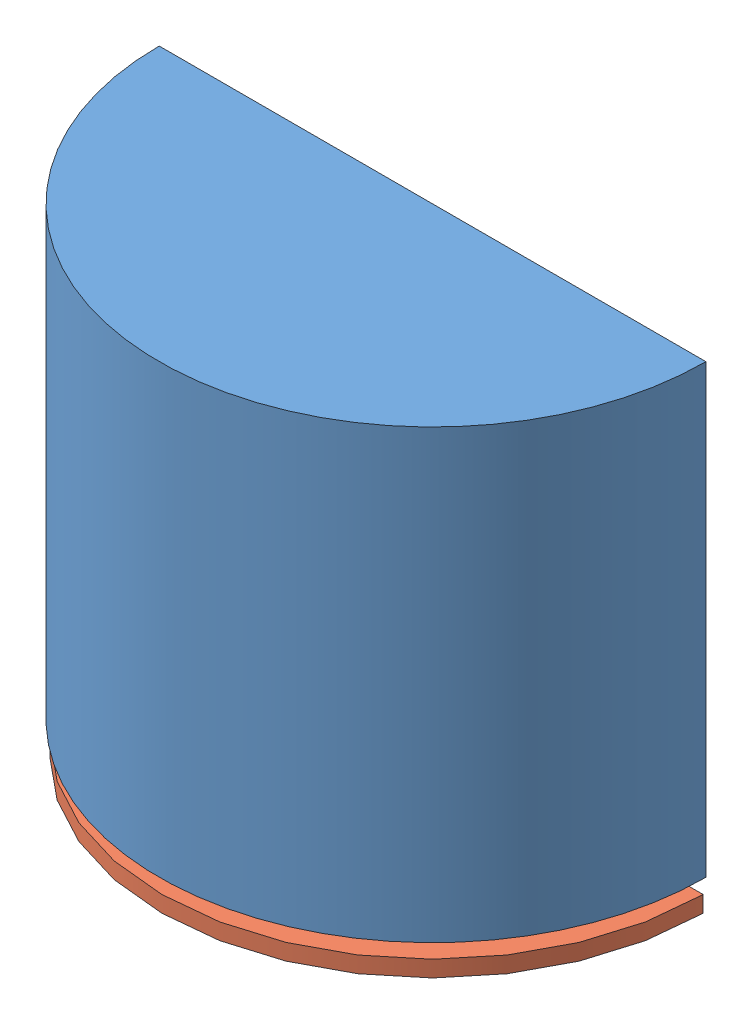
SolidWorks assembly Assem2.SLDASM, configuration По умолчанию (file format 9000). Lengths in mm.
Overall size (101 88.5 50.5).
2 component instances, 2 part files, 0 mates.
Components (placement in the parent):
- динамик_внешний-1: динамик_внешний.SLDPRT [По умолчанию] at (9.9917 -107.8122 -91.2063) size (101 82.5 50.5)
- динамик_внутр-1: динамик_внутр.SLDPRT [По умолчанию] at (9.9917 -107.8122 -91.2063) size (100 81.5 50)
